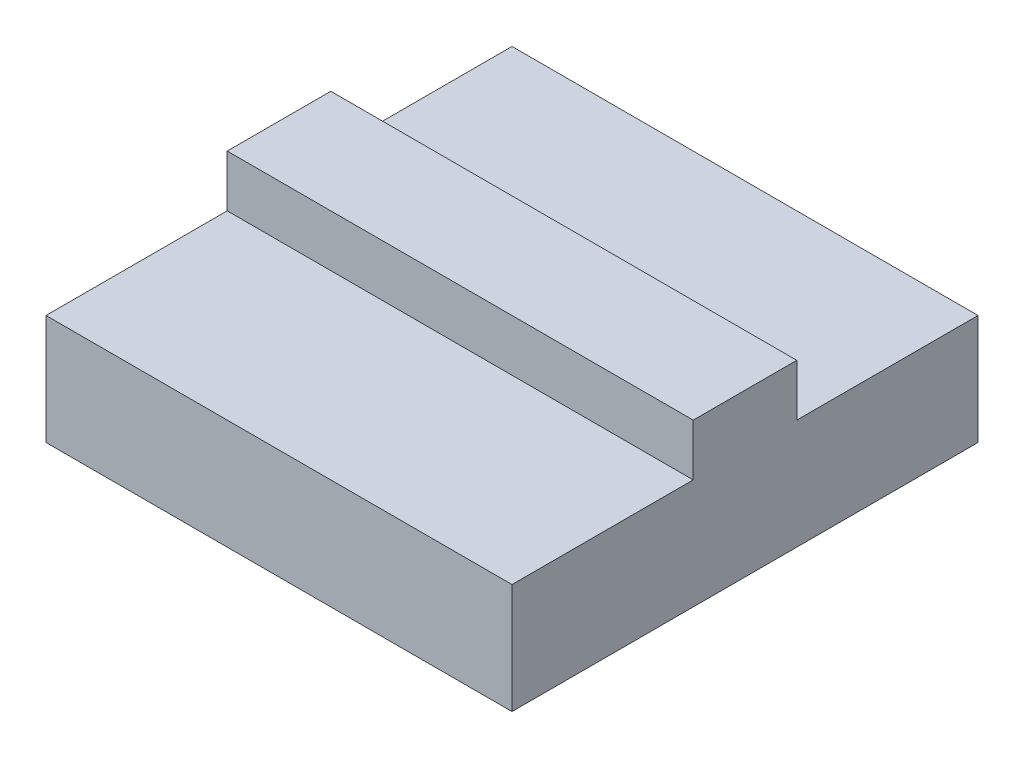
ISO-10303-21;
HEADER;
FILE_DESCRIPTION(('STEP AP214'),'2;1');
FILE_NAME('part.step','',(''),(''),'','','');
FILE_SCHEMA(('AUTOMOTIVE_DESIGN { 1 0 10303 214 1 1 1 1 }'));
ENDSEC;
DATA;
#1=APPLICATION_CONTEXT('core data for automotive mechanical design processes');
#2=APPLICATION_PROTOCOL_DEFINITION('international standard','automotive_design',2000,#1);
#3=PRODUCT_CONTEXT('',#1,'mechanical');
#4=PRODUCT('Part','Part','',(#3));
#5=PRODUCT_RELATED_PRODUCT_CATEGORY('part','',(#4));
#6=PRODUCT_DEFINITION_FORMATION('','',#4);
#7=PRODUCT_DEFINITION_CONTEXT('part definition',#1,'design');
#8=PRODUCT_DEFINITION('design','',#6,#7);
#9=PRODUCT_DEFINITION_SHAPE('','',#8);
#10=(LENGTH_UNIT() NAMED_UNIT(*) SI_UNIT(.MILLI.,.METRE.));
#11=(NAMED_UNIT(*) PLANE_ANGLE_UNIT() SI_UNIT($,.RADIAN.));
#12=(NAMED_UNIT(*) SI_UNIT($,.STERADIAN.) SOLID_ANGLE_UNIT());
#13=UNCERTAINTY_MEASURE_WITH_UNIT(LENGTH_MEASURE(1.E-05),#10,'distance_accuracy_value','');
#14=(GEOMETRIC_REPRESENTATION_CONTEXT(3) GLOBAL_UNCERTAINTY_ASSIGNED_CONTEXT((#13)) GLOBAL_UNIT_ASSIGNED_CONTEXT((#10,
#11,#12)) REPRESENTATION_CONTEXT('',''));
#15=CARTESIAN_POINT('',(0.,0.,0.));
#16=DIRECTION('',(0.,0.,1.));
#17=DIRECTION('',(1.,0.,0.));
#18=AXIS2_PLACEMENT_3D('',#15,#16,#17);
#19=CARTESIAN_POINT('',(0.,21.25,0.));
#20=DIRECTION('',(0.,-1.,0.));
#21=DIRECTION('',(0.,0.,-1.));
#22=AXIS2_PLACEMENT_3D('',#19,#20,#21);
#23=PLANE('',#22);
#24=DIRECTION('',(1.,0.,0.));
#25=VECTOR('',#24,1.);
#26=CARTESIAN_POINT('',(-67.3606797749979,21.25,10.));
#27=LINE('',#26,#25);
#28=CARTESIAN_POINT('',(-45.,21.25,9.99999999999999));
#29=VERTEX_POINT('',#28);
#30=CARTESIAN_POINT('',(45.,21.25,9.99999999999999));
#31=VERTEX_POINT('',#30);
#32=EDGE_CURVE('E75',#29,#31,#27,.T.);
#33=ORIENTED_EDGE('',*,*,#32,.F.);
#34=DIRECTION('',(0.,0.,1.));
#35=VECTOR('',#34,1.);
#36=CARTESIAN_POINT('',(-45.,21.25,-45.));
#37=LINE('',#36,#35);
#38=CARTESIAN_POINT('',(-45.,21.25,45.));
#39=VERTEX_POINT('',#38);
#40=EDGE_CURVE('E162',#29,#39,#37,.T.);
#41=ORIENTED_EDGE('',*,*,#40,.T.);
#42=DIRECTION('',(1.,0.,0.));
#43=VECTOR('',#42,1.);
#44=CARTESIAN_POINT('',(45.,21.25,45.));
#45=LINE('',#44,#43);
#46=CARTESIAN_POINT('',(45.,21.25,45.));
#47=VERTEX_POINT('',#46);
#48=EDGE_CURVE('E117',#39,#47,#45,.T.);
#49=ORIENTED_EDGE('',*,*,#48,.T.);
#50=DIRECTION('',(0.,0.,-1.));
#51=VECTOR('',#50,1.);
#52=CARTESIAN_POINT('',(45.,21.25,-45.));
#53=LINE('',#52,#51);
#54=EDGE_CURVE('E115',#47,#31,#53,.T.);
#55=ORIENTED_EDGE('',*,*,#54,.T.);
#56=EDGE_LOOP('',(#33,#41,#49,#55));
#57=FACE_BOUND('',#56,.T.);
#58=ADVANCED_FACE('F51',(#57),#23,.F.);
#59=CARTESIAN_POINT('',(-45.,21.25,-45.));
#60=DIRECTION('',(1.,0.,0.));
#61=DIRECTION('',(0.,0.,-1.));
#62=AXIS2_PLACEMENT_3D('',#59,#60,#61);
#63=PLANE('',#62);
#64=DIRECTION('',(0.,0.,1.));
#65=VECTOR('',#64,1.);
#66=CARTESIAN_POINT('',(-45.,0.,-45.));
#67=LINE('',#66,#65);
#68=CARTESIAN_POINT('',(-45.,0.,-45.));
#69=VERTEX_POINT('',#68);
#70=CARTESIAN_POINT('',(-45.,0.,45.));
#71=VERTEX_POINT('',#70);
#72=EDGE_CURVE('E168',#69,#71,#67,.T.);
#73=ORIENTED_EDGE('',*,*,#72,.T.);
#74=DIRECTION('',(0.,-1.,0.));
#75=VECTOR('',#74,1.);
#76=CARTESIAN_POINT('',(-45.,21.25,45.));
#77=LINE('',#76,#75);
#78=EDGE_CURVE('E11',#39,#71,#77,.T.);
#79=ORIENTED_EDGE('',*,*,#78,.F.);
#80=ORIENTED_EDGE('',*,*,#40,.F.);
#81=DIRECTION('',(0.,1.,0.));
#82=VECTOR('',#81,1.);
#83=CARTESIAN_POINT('',(-45.,21.25,10.));
#84=LINE('',#83,#82);
#85=CARTESIAN_POINT('',(-45.,31.25,10.));
#86=VERTEX_POINT('',#85);
#87=EDGE_CURVE('E133',#29,#86,#84,.T.);
#88=ORIENTED_EDGE('',*,*,#87,.T.);
#89=DIRECTION('',(0.,0.,-1.));
#90=VECTOR('',#89,1.);
#91=CARTESIAN_POINT('',(-45.,31.25,10.));
#92=LINE('',#91,#90);
#93=CARTESIAN_POINT('',(-45.,31.25,-9.99999999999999));
#94=VERTEX_POINT('',#93);
#95=EDGE_CURVE('E210',#86,#94,#92,.T.);
#96=ORIENTED_EDGE('',*,*,#95,.T.);
#97=DIRECTION('',(0.,-1.,0.));
#98=VECTOR('',#97,1.);
#99=CARTESIAN_POINT('',(-45.,21.25,-9.99999999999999));
#100=LINE('',#99,#98);
#101=CARTESIAN_POINT('',(-45.,21.25,-10.));
#102=VERTEX_POINT('',#101);
#103=EDGE_CURVE('E153',#94,#102,#100,.T.);
#104=ORIENTED_EDGE('',*,*,#103,.T.);
#105=CARTESIAN_POINT('',(-45.,21.25,-45.));
#106=VERTEX_POINT('',#105);
#107=EDGE_CURVE('E159',#106,#102,#37,.T.);
#108=ORIENTED_EDGE('',*,*,#107,.F.);
#109=DIRECTION('',(0.,-1.,0.));
#110=VECTOR('',#109,1.);
#111=CARTESIAN_POINT('',(-45.,21.25,-45.));
#112=LINE('',#111,#110);
#113=EDGE_CURVE('E167',#106,#69,#112,.T.);
#114=ORIENTED_EDGE('',*,*,#113,.T.);
#115=EDGE_LOOP('',(#73,#79,#80,#88,#96,#104,#108,#114));
#116=FACE_BOUND('',#115,.T.);
#117=ADVANCED_FACE('F53',(#116),#63,.F.);
#118=CARTESIAN_POINT('',(45.,21.25,45.));
#119=DIRECTION('',(0.,0.,-1.));
#120=DIRECTION('',(-1.,0.,0.));
#121=AXIS2_PLACEMENT_3D('',#118,#119,#120);
#122=PLANE('',#121);
#123=DIRECTION('',(1.,0.,0.));
#124=VECTOR('',#123,1.);
#125=CARTESIAN_POINT('',(45.,0.,45.));
#126=LINE('',#125,#124);
#127=CARTESIAN_POINT('',(45.,0.,45.));
#128=VERTEX_POINT('',#127);
#129=EDGE_CURVE('E172',#71,#128,#126,.T.);
#130=ORIENTED_EDGE('',*,*,#129,.T.);
#131=DIRECTION('',(0.,-1.,0.));
#132=VECTOR('',#131,1.);
#133=CARTESIAN_POINT('',(45.,21.25,45.));
#134=LINE('',#133,#132);
#135=EDGE_CURVE('E60',#47,#128,#134,.T.);
#136=ORIENTED_EDGE('',*,*,#135,.F.);
#137=ORIENTED_EDGE('',*,*,#48,.F.);
#138=ORIENTED_EDGE('',*,*,#78,.T.);
#139=EDGE_LOOP('',(#130,#136,#137,#138));
#140=FACE_BOUND('',#139,.T.);
#141=ADVANCED_FACE('F232',(#140),#122,.F.);
#142=CARTESIAN_POINT('',(45.,21.25,-45.));
#143=DIRECTION('',(-1.,0.,0.));
#144=DIRECTION('',(0.,0.,1.));
#145=AXIS2_PLACEMENT_3D('',#142,#143,#144);
#146=PLANE('',#145);
#147=DIRECTION('',(0.,0.,-1.));
#148=VECTOR('',#147,1.);
#149=CARTESIAN_POINT('',(45.,0.,-45.));
#150=LINE('',#149,#148);
#151=CARTESIAN_POINT('',(45.,0.,-45.));
#152=VERTEX_POINT('',#151);
#153=EDGE_CURVE('E175',#128,#152,#150,.T.);
#154=ORIENTED_EDGE('',*,*,#153,.T.);
#155=DIRECTION('',(0.,-1.,0.));
#156=VECTOR('',#155,1.);
#157=CARTESIAN_POINT('',(45.,21.25,-45.));
#158=LINE('',#157,#156);
#159=CARTESIAN_POINT('',(45.,21.25,-45.));
#160=VERTEX_POINT('',#159);
#161=EDGE_CURVE('E184',#160,#152,#158,.T.);
#162=ORIENTED_EDGE('',*,*,#161,.F.);
#163=CARTESIAN_POINT('',(45.,21.25,-10.));
#164=VERTEX_POINT('',#163);
#165=EDGE_CURVE('E124',#164,#160,#53,.T.);
#166=ORIENTED_EDGE('',*,*,#165,.F.);
#167=DIRECTION('',(0.,1.,0.));
#168=VECTOR('',#167,1.);
#169=CARTESIAN_POINT('',(45.,21.25,-10.));
#170=LINE('',#169,#168);
#171=CARTESIAN_POINT('',(45.,31.25,-10.));
#172=VERTEX_POINT('',#171);
#173=EDGE_CURVE('E141',#164,#172,#170,.T.);
#174=ORIENTED_EDGE('',*,*,#173,.T.);
#175=DIRECTION('',(0.,0.,1.));
#176=VECTOR('',#175,1.);
#177=CARTESIAN_POINT('',(45.,31.25,9.99999999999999));
#178=LINE('',#177,#176);
#179=CARTESIAN_POINT('',(45.,31.25,9.99999999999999));
#180=VERTEX_POINT('',#179);
#181=EDGE_CURVE('E135',#172,#180,#178,.T.);
#182=ORIENTED_EDGE('',*,*,#181,.T.);
#183=DIRECTION('',(0.,-1.,0.));
#184=VECTOR('',#183,1.);
#185=CARTESIAN_POINT('',(45.,21.25,9.99999999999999));
#186=LINE('',#185,#184);
#187=EDGE_CURVE('E131',#180,#31,#186,.T.);
#188=ORIENTED_EDGE('',*,*,#187,.T.);
#189=ORIENTED_EDGE('',*,*,#54,.F.);
#190=ORIENTED_EDGE('',*,*,#135,.T.);
#191=EDGE_LOOP('',(#154,#162,#166,#174,#182,#188,#189,#190));
#192=FACE_BOUND('',#191,.T.);
#193=ADVANCED_FACE('F137',(#192),#146,.F.);
#194=CARTESIAN_POINT('',(45.,21.25,-45.));
#195=DIRECTION('',(0.,0.,1.));
#196=DIRECTION('',(1.,0.,0.));
#197=AXIS2_PLACEMENT_3D('',#194,#195,#196);
#198=PLANE('',#197);
#199=DIRECTION('',(-1.,0.,0.));
#200=VECTOR('',#199,1.);
#201=CARTESIAN_POINT('',(45.,0.,-45.));
#202=LINE('',#201,#200);
#203=EDGE_CURVE('E178',#152,#69,#202,.T.);
#204=ORIENTED_EDGE('',*,*,#203,.T.);
#205=ORIENTED_EDGE('',*,*,#113,.F.);
#206=DIRECTION('',(-1.,0.,0.));
#207=VECTOR('',#206,1.);
#208=CARTESIAN_POINT('',(45.,21.25,-45.));
#209=LINE('',#208,#207);
#210=EDGE_CURVE('E123',#160,#106,#209,.T.);
#211=ORIENTED_EDGE('',*,*,#210,.F.);
#212=ORIENTED_EDGE('',*,*,#161,.T.);
#213=EDGE_LOOP('',(#204,#205,#211,#212));
#214=FACE_BOUND('',#213,.T.);
#215=ADVANCED_FACE('F197',(#214),#198,.F.);
#216=ORIENTED_EDGE('',*,*,#107,.T.);
#217=DIRECTION('',(1.,0.,0.));
#218=VECTOR('',#217,1.);
#219=CARTESIAN_POINT('',(-67.3606797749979,21.25,-9.99999999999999));
#220=LINE('',#219,#218);
#221=EDGE_CURVE('E67',#102,#164,#220,.T.);
#222=ORIENTED_EDGE('',*,*,#221,.T.);
#223=ORIENTED_EDGE('',*,*,#165,.T.);
#224=ORIENTED_EDGE('',*,*,#210,.T.);
#225=EDGE_LOOP('',(#216,#222,#223,#224));
#226=FACE_BOUND('',#225,.T.);
#227=ADVANCED_FACE('F204',(#226),#23,.F.);
#228=CARTESIAN_POINT('',(0.,0.,0.));
#229=DIRECTION('',(0.,-1.,0.));
#230=DIRECTION('',(0.,0.,-1.));
#231=AXIS2_PLACEMENT_3D('',#228,#229,#230);
#232=PLANE('',#231);
#233=ORIENTED_EDGE('',*,*,#72,.F.);
#234=ORIENTED_EDGE('',*,*,#203,.F.);
#235=ORIENTED_EDGE('',*,*,#153,.F.);
#236=ORIENTED_EDGE('',*,*,#129,.F.);
#237=EDGE_LOOP('',(#233,#234,#235,#236));
#238=FACE_BOUND('',#237,.T.);
#239=ADVANCED_FACE('F194',(#238),#232,.T.);
#240=CARTESIAN_POINT('',(-67.3606797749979,21.25,10.));
#241=DIRECTION('',(0.,0.,1.));
#242=DIRECTION('',(1.,0.,0.));
#243=AXIS2_PLACEMENT_3D('',#240,#241,#242);
#244=PLANE('',#243);
#245=ORIENTED_EDGE('',*,*,#87,.F.);
#246=ORIENTED_EDGE('',*,*,#32,.T.);
#247=ORIENTED_EDGE('',*,*,#187,.F.);
#248=DIRECTION('',(1.,0.,0.));
#249=VECTOR('',#248,1.);
#250=CARTESIAN_POINT('',(-67.3606797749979,31.25,10.));
#251=LINE('',#250,#249);
#252=EDGE_CURVE('E150',#86,#180,#251,.T.);
#253=ORIENTED_EDGE('',*,*,#252,.F.);
#254=EDGE_LOOP('',(#245,#246,#247,#253));
#255=FACE_BOUND('',#254,.T.);
#256=ADVANCED_FACE('F129',(#255),#244,.T.);
#257=CARTESIAN_POINT('',(-67.3606797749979,31.25,10.));
#258=DIRECTION('',(0.,1.,0.));
#259=DIRECTION('',(0.,0.,1.));
#260=AXIS2_PLACEMENT_3D('',#257,#258,#259);
#261=PLANE('',#260);
#262=ORIENTED_EDGE('',*,*,#95,.F.);
#263=ORIENTED_EDGE('',*,*,#252,.T.);
#264=ORIENTED_EDGE('',*,*,#181,.F.);
#265=DIRECTION('',(1.,0.,0.));
#266=VECTOR('',#265,1.);
#267=CARTESIAN_POINT('',(-67.3606797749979,31.25,-9.99999999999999));
#268=LINE('',#267,#266);
#269=EDGE_CURVE('E154',#94,#172,#268,.T.);
#270=ORIENTED_EDGE('',*,*,#269,.F.);
#271=EDGE_LOOP('',(#262,#263,#264,#270));
#272=FACE_BOUND('',#271,.T.);
#273=ADVANCED_FACE('F218',(#272),#261,.T.);
#274=CARTESIAN_POINT('',(-67.3606797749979,21.25,-9.99999999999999));
#275=DIRECTION('',(0.,0.,-1.));
#276=DIRECTION('',(-1.,0.,0.));
#277=AXIS2_PLACEMENT_3D('',#274,#275,#276);
#278=PLANE('',#277);
#279=ORIENTED_EDGE('',*,*,#103,.F.);
#280=ORIENTED_EDGE('',*,*,#269,.T.);
#281=ORIENTED_EDGE('',*,*,#173,.F.);
#282=ORIENTED_EDGE('',*,*,#221,.F.);
#283=EDGE_LOOP('',(#279,#280,#281,#282));
#284=FACE_BOUND('',#283,.T.);
#285=ADVANCED_FACE('F217',(#284),#278,.T.);
#286=CLOSED_SHELL('',(#58,#117,#141,#193,#215,#227,#239,#256,#273,#285));
#287=MANIFOLD_SOLID_BREP('B2',#286);
#288=ADVANCED_BREP_SHAPE_REPRESENTATION('',(#18,#287),#14);
#289=SHAPE_DEFINITION_REPRESENTATION(#9,#288);
ENDSEC;
END-ISO-10303-21;
